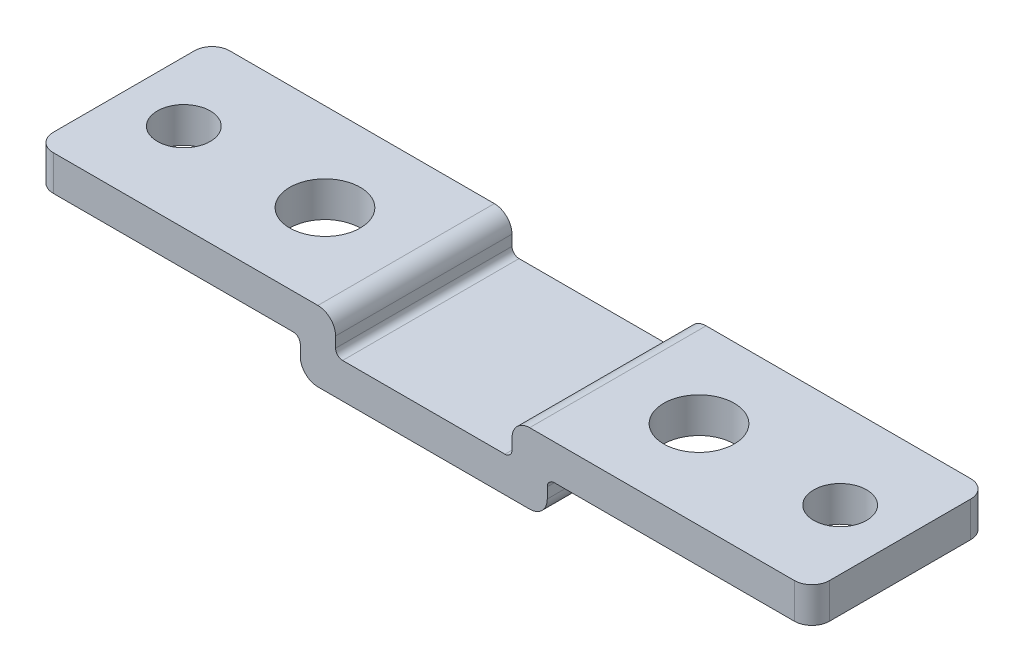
ISO-10303-21;
HEADER;
FILE_DESCRIPTION(('STEP AP214'),'2;1');
FILE_NAME('part.step','',(''),(''),'','','');
FILE_SCHEMA(('AUTOMOTIVE_DESIGN { 1 0 10303 214 1 1 1 1 }'));
ENDSEC;
DATA;
#1=APPLICATION_CONTEXT('core data for automotive mechanical design processes');
#2=APPLICATION_PROTOCOL_DEFINITION('international standard','automotive_design',2000,#1);
#3=PRODUCT_CONTEXT('',#1,'mechanical');
#4=PRODUCT('Part','Part','',(#3));
#5=PRODUCT_RELATED_PRODUCT_CATEGORY('part','',(#4));
#6=PRODUCT_DEFINITION_FORMATION('','',#4);
#7=PRODUCT_DEFINITION_CONTEXT('part definition',#1,'design');
#8=PRODUCT_DEFINITION('design','',#6,#7);
#9=PRODUCT_DEFINITION_SHAPE('','',#8);
#10=(LENGTH_UNIT() NAMED_UNIT(*) SI_UNIT(.MILLI.,.METRE.));
#11=(NAMED_UNIT(*) PLANE_ANGLE_UNIT() SI_UNIT($,.RADIAN.));
#12=(NAMED_UNIT(*) SI_UNIT($,.STERADIAN.) SOLID_ANGLE_UNIT());
#13=UNCERTAINTY_MEASURE_WITH_UNIT(LENGTH_MEASURE(1.E-05),#10,'distance_accuracy_value','');
#14=(GEOMETRIC_REPRESENTATION_CONTEXT(3) GLOBAL_UNCERTAINTY_ASSIGNED_CONTEXT((#13)) GLOBAL_UNIT_ASSIGNED_CONTEXT((#10,
#11,#12)) REPRESENTATION_CONTEXT('',''));
#15=CARTESIAN_POINT('',(0.,0.,0.));
#16=DIRECTION('',(0.,0.,1.));
#17=DIRECTION('',(1.,0.,0.));
#18=AXIS2_PLACEMENT_3D('',#15,#16,#17);
#19=CARTESIAN_POINT('',(-15.6273201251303,3.78748696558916,5.));
#20=DIRECTION('',(0.,-1.,0.));
#21=DIRECTION('',(1.,0.,0.));
#22=AXIS2_PLACEMENT_3D('',#19,#20,#21);
#23=PLANE('',#22);
#24=DIRECTION('',(-1.,0.,0.));
#25=VECTOR('',#24,1.);
#26=CARTESIAN_POINT('',(-15.6273201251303,3.78748696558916,0.));
#27=LINE('',#26,#25);
#28=CARTESIAN_POINT('',(-11.0273201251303,3.78748696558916,0.));
#29=VERTEX_POINT('',#28);
#30=CARTESIAN_POINT('',(-15.6273201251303,3.78748696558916,0.));
#31=VERTEX_POINT('',#30);
#32=EDGE_CURVE('E197',#29,#31,#27,.T.);
#33=ORIENTED_EDGE('',*,*,#32,.T.);
#34=DIRECTION('',(0.,0.,-1.));
#35=VECTOR('',#34,1.);
#36=CARTESIAN_POINT('',(-15.6273201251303,3.78748696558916,5.));
#37=LINE('',#36,#35);
#38=CARTESIAN_POINT('',(-15.6273201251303,3.78748696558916,5.));
#39=VERTEX_POINT('',#38);
#40=EDGE_CURVE('E324',#39,#31,#37,.T.);
#41=ORIENTED_EDGE('',*,*,#40,.F.);
#42=DIRECTION('',(-1.,0.,0.));
#43=VECTOR('',#42,1.);
#44=CARTESIAN_POINT('',(-15.6273201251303,3.78748696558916,5.));
#45=LINE('',#44,#43);
#46=CARTESIAN_POINT('',(-11.0273201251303,3.78748696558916,5.));
#47=VERTEX_POINT('',#46);
#48=EDGE_CURVE('E221',#47,#39,#45,.T.);
#49=ORIENTED_EDGE('',*,*,#48,.F.);
#50=DIRECTION('',(0.,0.,-1.));
#51=VECTOR('',#50,1.);
#52=CARTESIAN_POINT('',(-11.0273201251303,3.78748696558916,5.));
#53=LINE('',#52,#51);
#54=EDGE_CURVE('E215',#47,#29,#53,.T.);
#55=ORIENTED_EDGE('',*,*,#54,.T.);
#56=EDGE_LOOP('',(#33,#41,#49,#55));
#57=FACE_BOUND('',#56,.T.);
#58=ADVANCED_FACE('F35',(#57),#23,.F.);
#59=CARTESIAN_POINT('',(-15.6273201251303,3.98748696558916,5.));
#60=DIRECTION('',(0.,0.,-1.));
#61=DIRECTION('',(-1.,0.,0.));
#62=AXIS2_PLACEMENT_3D('',#59,#60,#61);
#63=CYLINDRICAL_SURFACE('',#62,0.199999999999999);
#64=CARTESIAN_POINT('',(-15.6273201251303,3.98748696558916,0.));
#65=DIRECTION('',(0.,0.,-1.));
#66=DIRECTION('',(1.,0.,0.));
#67=AXIS2_PLACEMENT_3D('',#64,#65,#66);
#68=CIRCLE('',#67,0.199999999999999);
#69=CARTESIAN_POINT('',(-15.8273201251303,3.98748696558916,0.));
#70=VERTEX_POINT('',#69);
#71=EDGE_CURVE('E203',#31,#70,#68,.T.);
#72=ORIENTED_EDGE('',*,*,#71,.T.);
#73=DIRECTION('',(0.,0.,-1.));
#74=VECTOR('',#73,1.);
#75=CARTESIAN_POINT('',(-15.8273201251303,3.98748696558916,5.));
#76=LINE('',#75,#74);
#77=CARTESIAN_POINT('',(-15.8273201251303,3.98748696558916,5.));
#78=VERTEX_POINT('',#77);
#79=EDGE_CURVE('E321',#78,#70,#76,.T.);
#80=ORIENTED_EDGE('',*,*,#79,.F.);
#81=CARTESIAN_POINT('',(-15.6273201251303,3.98748696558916,5.));
#82=DIRECTION('',(0.,0.,-1.));
#83=DIRECTION('',(1.,0.,0.));
#84=AXIS2_PLACEMENT_3D('',#81,#82,#83);
#85=CIRCLE('',#84,0.199999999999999);
#86=EDGE_CURVE('E279',#39,#78,#85,.T.);
#87=ORIENTED_EDGE('',*,*,#86,.F.);
#88=ORIENTED_EDGE('',*,*,#40,.T.);
#89=EDGE_LOOP('',(#72,#80,#87,#88));
#90=FACE_BOUND('',#89,.T.);
#91=ADVANCED_FACE('F361',(#90),#63,.F.);
#92=CARTESIAN_POINT('',(-15.8273201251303,4.28748696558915,5.));
#93=DIRECTION('',(-1.,0.,0.));
#94=DIRECTION('',(0.,0.,1.));
#95=AXIS2_PLACEMENT_3D('',#92,#93,#94);
#96=PLANE('',#95);
#97=DIRECTION('',(0.,1.,0.));
#98=VECTOR('',#97,1.);
#99=CARTESIAN_POINT('',(-15.8273201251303,4.28748696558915,0.));
#100=LINE('',#99,#98);
#101=CARTESIAN_POINT('',(-15.8273201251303,4.28748696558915,0.));
#102=VERTEX_POINT('',#101);
#103=EDGE_CURVE('E262',#70,#102,#100,.T.);
#104=ORIENTED_EDGE('',*,*,#103,.T.);
#105=DIRECTION('',(0.,0.,-1.));
#106=VECTOR('',#105,1.);
#107=CARTESIAN_POINT('',(-15.8273201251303,4.28748696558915,5.));
#108=LINE('',#107,#106);
#109=CARTESIAN_POINT('',(-15.8273201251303,4.28748696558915,5.));
#110=VERTEX_POINT('',#109);
#111=EDGE_CURVE('E318',#110,#102,#108,.T.);
#112=ORIENTED_EDGE('',*,*,#111,.F.);
#113=DIRECTION('',(0.,1.,0.));
#114=VECTOR('',#113,1.);
#115=CARTESIAN_POINT('',(-15.8273201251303,4.28748696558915,5.));
#116=LINE('',#115,#114);
#117=EDGE_CURVE('E281',#78,#110,#116,.T.);
#118=ORIENTED_EDGE('',*,*,#117,.F.);
#119=ORIENTED_EDGE('',*,*,#79,.T.);
#120=EDGE_LOOP('',(#104,#112,#118,#119));
#121=FACE_BOUND('',#120,.T.);
#122=ADVANCED_FACE('F365',(#121),#96,.F.);
#123=CARTESIAN_POINT('',(-16.3273201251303,4.28748696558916,5.));
#124=DIRECTION('',(0.,0.,-1.));
#125=DIRECTION('',(-1.,0.,0.));
#126=AXIS2_PLACEMENT_3D('',#123,#124,#125);
#127=CYLINDRICAL_SURFACE('',#126,0.5);
#128=CARTESIAN_POINT('',(-16.3273201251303,4.28748696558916,0.));
#129=DIRECTION('',(0.,0.,1.));
#130=DIRECTION('',(-1.,0.,0.));
#131=AXIS2_PLACEMENT_3D('',#128,#129,#130);
#132=CIRCLE('',#131,0.5);
#133=CARTESIAN_POINT('',(-16.3273201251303,4.78748696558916,0.));
#134=VERTEX_POINT('',#133);
#135=EDGE_CURVE('E264',#102,#134,#132,.T.);
#136=ORIENTED_EDGE('',*,*,#135,.T.);
#137=DIRECTION('',(0.,0.,-1.));
#138=VECTOR('',#137,1.);
#139=CARTESIAN_POINT('',(-16.3273201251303,4.78748696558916,5.));
#140=LINE('',#139,#138);
#141=CARTESIAN_POINT('',(-16.3273201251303,4.78748696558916,5.));
#142=VERTEX_POINT('',#141);
#143=EDGE_CURVE('E315',#142,#134,#140,.T.);
#144=ORIENTED_EDGE('',*,*,#143,.F.);
#145=CARTESIAN_POINT('',(-16.3273201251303,4.28748696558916,5.));
#146=DIRECTION('',(0.,0.,1.));
#147=DIRECTION('',(-1.,0.,0.));
#148=AXIS2_PLACEMENT_3D('',#145,#146,#147);
#149=CIRCLE('',#148,0.5);
#150=EDGE_CURVE('E283',#110,#142,#149,.T.);
#151=ORIENTED_EDGE('',*,*,#150,.F.);
#152=ORIENTED_EDGE('',*,*,#111,.T.);
#153=EDGE_LOOP('',(#136,#144,#151,#152));
#154=FACE_BOUND('',#153,.T.);
#155=ADVANCED_FACE('F370',(#154),#127,.T.);
#156=CARTESIAN_POINT('',(-24.3273201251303,4.78748696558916,5.));
#157=DIRECTION('',(0.,-1.,0.));
#158=DIRECTION('',(0.,0.,-1.));
#159=AXIS2_PLACEMENT_3D('',#156,#157,#158);
#160=PLANE('',#159);
#161=CARTESIAN_POINT('',(-22.6273201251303,4.78748696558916,2.5));
#162=DIRECTION('',(0.,1.,0.));
#163=DIRECTION('',(0.,0.,1.));
#164=AXIS2_PLACEMENT_3D('',#161,#162,#163);
#165=CIRCLE('',#164,0.750000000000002);
#166=CARTESIAN_POINT('',(-22.6273201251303,4.78748696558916,3.25));
#167=VERTEX_POINT('',#166);
#168=EDGE_CURVE('E248',#167,#167,#165,.T.);
#169=ORIENTED_EDGE('',*,*,#168,.F.);
#170=EDGE_LOOP('',(#169));
#171=FACE_BOUND('',#170,.T.);
#172=CARTESIAN_POINT('',(-18.6273201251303,4.78748696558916,2.5));
#173=DIRECTION('',(0.,1.,0.));
#174=DIRECTION('',(0.,0.,1.));
#175=AXIS2_PLACEMENT_3D('',#172,#173,#174);
#176=CIRCLE('',#175,1.);
#177=CARTESIAN_POINT('',(-18.6273201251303,4.78748696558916,3.5));
#178=VERTEX_POINT('',#177);
#179=EDGE_CURVE('E258',#178,#178,#176,.T.);
#180=ORIENTED_EDGE('',*,*,#179,.F.);
#181=EDGE_LOOP('',(#180));
#182=FACE_BOUND('',#181,.T.);
#183=DIRECTION('',(0.,0.,-1.));
#184=VECTOR('',#183,1.);
#185=CARTESIAN_POINT('',(-24.3273201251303,4.78748696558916,5.));
#186=LINE('',#185,#184);
#187=CARTESIAN_POINT('',(-24.3273201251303,4.78748696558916,4.5));
#188=VERTEX_POINT('',#187);
#189=CARTESIAN_POINT('',(-24.3273201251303,4.78748696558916,0.5));
#190=VERTEX_POINT('',#189);
#191=EDGE_CURVE('E313',#188,#190,#186,.T.);
#192=ORIENTED_EDGE('',*,*,#191,.F.);
#193=CARTESIAN_POINT('',(-23.8273201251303,4.78748696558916,4.5));
#194=DIRECTION('',(0.,-1.,0.));
#195=DIRECTION('',(0.,0.,-1.));
#196=AXIS2_PLACEMENT_3D('',#193,#194,#195);
#197=CIRCLE('',#196,0.5);
#198=CARTESIAN_POINT('',(-23.8273201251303,4.78748696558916,5.));
#199=VERTEX_POINT('',#198);
#200=EDGE_CURVE('E43',#188,#199,#197,.F.);
#201=ORIENTED_EDGE('',*,*,#200,.T.);
#202=DIRECTION('',(-1.,0.,0.));
#203=VECTOR('',#202,1.);
#204=CARTESIAN_POINT('',(-24.3273201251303,4.78748696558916,5.));
#205=LINE('',#204,#203);
#206=EDGE_CURVE('E285',#142,#199,#205,.T.);
#207=ORIENTED_EDGE('',*,*,#206,.F.);
#208=ORIENTED_EDGE('',*,*,#143,.T.);
#209=DIRECTION('',(-1.,0.,0.));
#210=VECTOR('',#209,1.);
#211=CARTESIAN_POINT('',(-24.3273201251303,4.78748696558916,0.));
#212=LINE('',#211,#210);
#213=CARTESIAN_POINT('',(-23.8273201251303,4.78748696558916,0.));
#214=VERTEX_POINT('',#213);
#215=EDGE_CURVE('E266',#134,#214,#212,.T.);
#216=ORIENTED_EDGE('',*,*,#215,.T.);
#217=CARTESIAN_POINT('',(-23.8273201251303,4.78748696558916,0.5));
#218=DIRECTION('',(0.,-1.,0.));
#219=DIRECTION('',(0.,0.,-1.));
#220=AXIS2_PLACEMENT_3D('',#217,#218,#219);
#221=CIRCLE('',#220,0.5);
#222=EDGE_CURVE('E56',#214,#190,#221,.F.);
#223=ORIENTED_EDGE('',*,*,#222,.T.);
#224=EDGE_LOOP('',(#192,#201,#207,#208,#216,#223));
#225=FACE_BOUND('',#224,.T.);
#226=ADVANCED_FACE('F376',(#171,#182,#225),#160,.F.);
#227=CARTESIAN_POINT('',(-24.3273201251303,3.78748696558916,5.));
#228=DIRECTION('',(1.,0.,0.));
#229=DIRECTION('',(0.,0.,-1.));
#230=AXIS2_PLACEMENT_3D('',#227,#228,#229);
#231=PLANE('',#230);
#232=DIRECTION('',(0.,0.,-1.));
#233=VECTOR('',#232,1.);
#234=CARTESIAN_POINT('',(-24.3273201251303,3.78748696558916,5.));
#235=LINE('',#234,#233);
#236=CARTESIAN_POINT('',(-24.3273201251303,3.78748696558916,4.5));
#237=VERTEX_POINT('',#236);
#238=CARTESIAN_POINT('',(-24.3273201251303,3.78748696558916,0.5));
#239=VERTEX_POINT('',#238);
#240=EDGE_CURVE('E310',#237,#239,#235,.T.);
#241=ORIENTED_EDGE('',*,*,#240,.F.);
#242=DIRECTION('',(0.,-1.,0.));
#243=VECTOR('',#242,1.);
#244=CARTESIAN_POINT('',(-24.3273201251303,3.78748696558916,4.5));
#245=LINE('',#244,#243);
#246=EDGE_CURVE('E336',#237,#188,#245,.F.);
#247=ORIENTED_EDGE('',*,*,#246,.T.);
#248=ORIENTED_EDGE('',*,*,#191,.T.);
#249=DIRECTION('',(0.,-1.,0.));
#250=VECTOR('',#249,1.);
#251=CARTESIAN_POINT('',(-24.3273201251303,3.78748696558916,0.5));
#252=LINE('',#251,#250);
#253=EDGE_CURVE('E333',#190,#239,#252,.T.);
#254=ORIENTED_EDGE('',*,*,#253,.T.);
#255=EDGE_LOOP('',(#241,#247,#248,#254));
#256=FACE_BOUND('',#255,.T.);
#257=ADVANCED_FACE('F380',(#256),#231,.F.);
#258=CARTESIAN_POINT('',(-17.0273201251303,3.78748696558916,5.));
#259=DIRECTION('',(0.,1.,0.));
#260=DIRECTION('',(0.,0.,1.));
#261=AXIS2_PLACEMENT_3D('',#258,#259,#260);
#262=PLANE('',#261);
#263=CARTESIAN_POINT('',(-22.6273201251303,3.78748696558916,2.5));
#264=DIRECTION('',(0.,1.,0.));
#265=DIRECTION('',(0.,0.,1.));
#266=AXIS2_PLACEMENT_3D('',#263,#264,#265);
#267=CIRCLE('',#266,0.750000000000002);
#268=CARTESIAN_POINT('',(-22.6273201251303,3.78748696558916,3.25));
#269=VERTEX_POINT('',#268);
#270=EDGE_CURVE('E38',#269,#269,#267,.T.);
#271=ORIENTED_EDGE('',*,*,#270,.T.);
#272=EDGE_LOOP('',(#271));
#273=FACE_BOUND('',#272,.T.);
#274=CARTESIAN_POINT('',(-18.6273201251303,3.78748696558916,2.5));
#275=DIRECTION('',(0.,1.,0.));
#276=DIRECTION('',(0.,0.,1.));
#277=AXIS2_PLACEMENT_3D('',#274,#275,#276);
#278=CIRCLE('',#277,1.);
#279=CARTESIAN_POINT('',(-18.6273201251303,3.78748696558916,3.5));
#280=VERTEX_POINT('',#279);
#281=EDGE_CURVE('E208',#280,#280,#278,.T.);
#282=ORIENTED_EDGE('',*,*,#281,.T.);
#283=EDGE_LOOP('',(#282));
#284=FACE_BOUND('',#283,.T.);
#285=DIRECTION('',(1.,0.,0.));
#286=VECTOR('',#285,1.);
#287=CARTESIAN_POINT('',(-17.0273201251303,3.78748696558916,5.));
#288=LINE('',#287,#286);
#289=CARTESIAN_POINT('',(-23.8273201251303,3.78748696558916,5.));
#290=VERTEX_POINT('',#289);
#291=CARTESIAN_POINT('',(-17.0273201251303,3.78748696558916,5.));
#292=VERTEX_POINT('',#291);
#293=EDGE_CURVE('E288',#290,#292,#288,.T.);
#294=ORIENTED_EDGE('',*,*,#293,.F.);
#295=CARTESIAN_POINT('',(-23.8273201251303,3.78748696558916,4.5));
#296=DIRECTION('',(0.,1.,0.));
#297=DIRECTION('',(0.,0.,1.));
#298=AXIS2_PLACEMENT_3D('',#295,#296,#297);
#299=CIRCLE('',#298,0.5);
#300=EDGE_CURVE('E331',#290,#237,#299,.F.);
#301=ORIENTED_EDGE('',*,*,#300,.T.);
#302=ORIENTED_EDGE('',*,*,#240,.T.);
#303=CARTESIAN_POINT('',(-23.8273201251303,3.78748696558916,0.5));
#304=DIRECTION('',(0.,1.,0.));
#305=DIRECTION('',(0.,0.,1.));
#306=AXIS2_PLACEMENT_3D('',#303,#304,#305);
#307=CIRCLE('',#306,0.5);
#308=CARTESIAN_POINT('',(-23.8273201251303,3.78748696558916,0.));
#309=VERTEX_POINT('',#308);
#310=EDGE_CURVE('E329',#239,#309,#307,.F.);
#311=ORIENTED_EDGE('',*,*,#310,.T.);
#312=DIRECTION('',(1.,0.,0.));
#313=VECTOR('',#312,1.);
#314=CARTESIAN_POINT('',(-17.0273201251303,3.78748696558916,0.));
#315=LINE('',#314,#313);
#316=CARTESIAN_POINT('',(-17.0273201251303,3.78748696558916,0.));
#317=VERTEX_POINT('',#316);
#318=EDGE_CURVE('E268',#309,#317,#315,.T.);
#319=ORIENTED_EDGE('',*,*,#318,.T.);
#320=DIRECTION('',(0.,0.,-1.));
#321=VECTOR('',#320,1.);
#322=CARTESIAN_POINT('',(-17.0273201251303,3.78748696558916,5.));
#323=LINE('',#322,#321);
#324=EDGE_CURVE('E307',#292,#317,#323,.T.);
#325=ORIENTED_EDGE('',*,*,#324,.F.);
#326=EDGE_LOOP('',(#294,#301,#302,#311,#319,#325));
#327=FACE_BOUND('',#326,.T.);
#328=ADVANCED_FACE('F342',(#273,#284,#327),#262,.F.);
#329=CARTESIAN_POINT('',(-17.0273201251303,3.58748696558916,5.));
#330=DIRECTION('',(0.,0.,-1.));
#331=DIRECTION('',(-1.,0.,0.));
#332=AXIS2_PLACEMENT_3D('',#329,#330,#331);
#333=CYLINDRICAL_SURFACE('',#332,0.199999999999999);
#334=CARTESIAN_POINT('',(-17.0273201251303,3.58748696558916,0.));
#335=DIRECTION('',(0.,0.,-1.));
#336=DIRECTION('',(1.,0.,0.));
#337=AXIS2_PLACEMENT_3D('',#334,#335,#336);
#338=CIRCLE('',#337,0.199999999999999);
#339=CARTESIAN_POINT('',(-16.8273201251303,3.58748696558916,0.));
#340=VERTEX_POINT('',#339);
#341=EDGE_CURVE('E270',#317,#340,#338,.T.);
#342=ORIENTED_EDGE('',*,*,#341,.T.);
#343=DIRECTION('',(0.,0.,-1.));
#344=VECTOR('',#343,1.);
#345=CARTESIAN_POINT('',(-16.8273201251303,3.58748696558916,5.));
#346=LINE('',#345,#344);
#347=CARTESIAN_POINT('',(-16.8273201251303,3.58748696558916,5.));
#348=VERTEX_POINT('',#347);
#349=EDGE_CURVE('E304',#348,#340,#346,.T.);
#350=ORIENTED_EDGE('',*,*,#349,.F.);
#351=CARTESIAN_POINT('',(-17.0273201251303,3.58748696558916,5.));
#352=DIRECTION('',(0.,0.,-1.));
#353=DIRECTION('',(1.,0.,0.));
#354=AXIS2_PLACEMENT_3D('',#351,#352,#353);
#355=CIRCLE('',#354,0.199999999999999);
#356=EDGE_CURVE('E290',#292,#348,#355,.T.);
#357=ORIENTED_EDGE('',*,*,#356,.F.);
#358=ORIENTED_EDGE('',*,*,#324,.T.);
#359=EDGE_LOOP('',(#342,#350,#357,#358));
#360=FACE_BOUND('',#359,.T.);
#361=ADVANCED_FACE('F387',(#360),#333,.F.);
#362=CARTESIAN_POINT('',(-16.8273201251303,3.28748696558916,5.));
#363=DIRECTION('',(1.,0.,0.));
#364=DIRECTION('',(0.,0.,-1.));
#365=AXIS2_PLACEMENT_3D('',#362,#363,#364);
#366=PLANE('',#365);
#367=DIRECTION('',(0.,-1.,0.));
#368=VECTOR('',#367,1.);
#369=CARTESIAN_POINT('',(-16.8273201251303,3.28748696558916,0.));
#370=LINE('',#369,#368);
#371=CARTESIAN_POINT('',(-16.8273201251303,3.28748696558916,0.));
#372=VERTEX_POINT('',#371);
#373=EDGE_CURVE('E272',#340,#372,#370,.T.);
#374=ORIENTED_EDGE('',*,*,#373,.T.);
#375=DIRECTION('',(0.,0.,-1.));
#376=VECTOR('',#375,1.);
#377=CARTESIAN_POINT('',(-16.8273201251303,3.28748696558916,5.));
#378=LINE('',#377,#376);
#379=CARTESIAN_POINT('',(-16.8273201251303,3.28748696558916,5.));
#380=VERTEX_POINT('',#379);
#381=EDGE_CURVE('E301',#380,#372,#378,.T.);
#382=ORIENTED_EDGE('',*,*,#381,.F.);
#383=DIRECTION('',(0.,-1.,0.));
#384=VECTOR('',#383,1.);
#385=CARTESIAN_POINT('',(-16.8273201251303,3.28748696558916,5.));
#386=LINE('',#385,#384);
#387=EDGE_CURVE('E292',#348,#380,#386,.T.);
#388=ORIENTED_EDGE('',*,*,#387,.F.);
#389=ORIENTED_EDGE('',*,*,#349,.T.);
#390=EDGE_LOOP('',(#374,#382,#388,#389));
#391=FACE_BOUND('',#390,.T.);
#392=ADVANCED_FACE('F391',(#391),#366,.F.);
#393=CARTESIAN_POINT('',(-16.3273201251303,3.28748696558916,5.));
#394=DIRECTION('',(0.,0.,-1.));
#395=DIRECTION('',(-1.,0.,0.));
#396=AXIS2_PLACEMENT_3D('',#393,#394,#395);
#397=CYLINDRICAL_SURFACE('',#396,0.5);
#398=CARTESIAN_POINT('',(-16.3273201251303,3.28748696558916,0.));
#399=DIRECTION('',(0.,0.,1.));
#400=DIRECTION('',(-1.,0.,0.));
#401=AXIS2_PLACEMENT_3D('',#398,#399,#400);
#402=CIRCLE('',#401,0.5);
#403=CARTESIAN_POINT('',(-16.3273201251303,2.78748696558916,0.));
#404=VERTEX_POINT('',#403);
#405=EDGE_CURVE('E274',#372,#404,#402,.T.);
#406=ORIENTED_EDGE('',*,*,#405,.T.);
#407=DIRECTION('',(0.,0.,-1.));
#408=VECTOR('',#407,1.);
#409=CARTESIAN_POINT('',(-16.3273201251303,2.78748696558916,5.));
#410=LINE('',#409,#408);
#411=CARTESIAN_POINT('',(-16.3273201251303,2.78748696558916,5.));
#412=VERTEX_POINT('',#411);
#413=EDGE_CURVE('E298',#412,#404,#410,.T.);
#414=ORIENTED_EDGE('',*,*,#413,.F.);
#415=CARTESIAN_POINT('',(-16.3273201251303,3.28748696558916,5.));
#416=DIRECTION('',(0.,0.,1.));
#417=DIRECTION('',(-1.,0.,0.));
#418=AXIS2_PLACEMENT_3D('',#415,#416,#417);
#419=CIRCLE('',#418,0.5);
#420=EDGE_CURVE('E294',#380,#412,#419,.T.);
#421=ORIENTED_EDGE('',*,*,#420,.F.);
#422=ORIENTED_EDGE('',*,*,#381,.T.);
#423=EDGE_LOOP('',(#406,#414,#421,#422));
#424=FACE_BOUND('',#423,.T.);
#425=ADVANCED_FACE('F395',(#424),#397,.T.);
#426=CARTESIAN_POINT('',(-13.3273201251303,2.78748696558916,5.));
#427=DIRECTION('',(0.,1.,0.));
#428=DIRECTION('',(-1.,0.,0.));
#429=AXIS2_PLACEMENT_3D('',#426,#427,#428);
#430=PLANE('',#429);
#431=DIRECTION('',(1.,0.,0.));
#432=VECTOR('',#431,1.);
#433=CARTESIAN_POINT('',(-13.3273201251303,2.78748696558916,0.));
#434=LINE('',#433,#432);
#435=CARTESIAN_POINT('',(-10.3273201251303,2.78748696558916,0.));
#436=VERTEX_POINT('',#435);
#437=EDGE_CURVE('E276',#404,#436,#434,.T.);
#438=ORIENTED_EDGE('',*,*,#437,.T.);
#439=DIRECTION('',(0.,0.,-1.));
#440=VECTOR('',#439,1.);
#441=CARTESIAN_POINT('',(-10.3273201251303,2.78748696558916,5.));
#442=LINE('',#441,#440);
#443=CARTESIAN_POINT('',(-10.3273201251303,2.78748696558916,5.));
#444=VERTEX_POINT('',#443);
#445=EDGE_CURVE('E455',#444,#436,#442,.T.);
#446=ORIENTED_EDGE('',*,*,#445,.F.);
#447=DIRECTION('',(1.,0.,0.));
#448=VECTOR('',#447,1.);
#449=CARTESIAN_POINT('',(-13.3273201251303,2.78748696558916,5.));
#450=LINE('',#449,#448);
#451=EDGE_CURVE('E296',#412,#444,#450,.T.);
#452=ORIENTED_EDGE('',*,*,#451,.F.);
#453=ORIENTED_EDGE('',*,*,#413,.T.);
#454=EDGE_LOOP('',(#438,#446,#452,#453));
#455=FACE_BOUND('',#454,.T.);
#456=ADVANCED_FACE('F399',(#455),#430,.F.);
#457=CARTESIAN_POINT('',(-16.3273201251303,3.28748696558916,5.));
#458=DIRECTION('',(0.,0.,-1.));
#459=DIRECTION('',(-1.,0.,0.));
#460=AXIS2_PLACEMENT_3D('',#457,#458,#459);
#461=PLANE('',#460);
#462=ORIENTED_EDGE('',*,*,#206,.T.);
#463=DIRECTION('',(0.,-1.,0.));
#464=VECTOR('',#463,1.);
#465=CARTESIAN_POINT('',(-23.8273201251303,3.28748696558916,5.));
#466=LINE('',#465,#464);
#467=EDGE_CURVE('E326',#199,#290,#466,.T.);
#468=ORIENTED_EDGE('',*,*,#467,.T.);
#469=ORIENTED_EDGE('',*,*,#293,.T.);
#470=ORIENTED_EDGE('',*,*,#356,.T.);
#471=ORIENTED_EDGE('',*,*,#387,.T.);
#472=ORIENTED_EDGE('',*,*,#420,.T.);
#473=ORIENTED_EDGE('',*,*,#451,.T.);
#474=CARTESIAN_POINT('',(-10.3273201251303,3.28748696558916,5.));
#475=DIRECTION('',(0.,0.,-1.));
#476=DIRECTION('',(1.,0.,0.));
#477=AXIS2_PLACEMENT_3D('',#474,#475,#476);
#478=CIRCLE('',#477,0.5);
#479=CARTESIAN_POINT('',(-9.82732012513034,3.28748696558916,5.));
#480=VERTEX_POINT('',#479);
#481=EDGE_CURVE('E452',#480,#444,#478,.T.);
#482=ORIENTED_EDGE('',*,*,#481,.F.);
#483=DIRECTION('',(0.,-1.,0.));
#484=VECTOR('',#483,1.);
#485=CARTESIAN_POINT('',(-9.82732012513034,3.28748696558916,5.));
#486=LINE('',#485,#484);
#487=CARTESIAN_POINT('',(-9.82732012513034,3.58748696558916,5.));
#488=VERTEX_POINT('',#487);
#489=EDGE_CURVE('E449',#488,#480,#486,.T.);
#490=ORIENTED_EDGE('',*,*,#489,.F.);
#491=CARTESIAN_POINT('',(-9.62732012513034,3.58748696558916,5.));
#492=DIRECTION('',(0.,0.,1.));
#493=DIRECTION('',(-1.,0.,0.));
#494=AXIS2_PLACEMENT_3D('',#491,#492,#493);
#495=CIRCLE('',#494,0.199999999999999);
#496=CARTESIAN_POINT('',(-9.62732012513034,3.78748696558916,5.));
#497=VERTEX_POINT('',#496);
#498=EDGE_CURVE('E446',#497,#488,#495,.T.);
#499=ORIENTED_EDGE('',*,*,#498,.F.);
#500=DIRECTION('',(-1.,0.,0.));
#501=VECTOR('',#500,1.);
#502=CARTESIAN_POINT('',(-9.62732012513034,3.78748696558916,5.));
#503=LINE('',#502,#501);
#504=CARTESIAN_POINT('',(-2.82732012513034,3.78748696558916,5.));
#505=VERTEX_POINT('',#504);
#506=EDGE_CURVE('E443',#505,#497,#503,.T.);
#507=ORIENTED_EDGE('',*,*,#506,.F.);
#508=DIRECTION('',(0.,-1.,0.));
#509=VECTOR('',#508,1.);
#510=CARTESIAN_POINT('',(-2.82732012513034,3.28748696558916,5.));
#511=LINE('',#510,#509);
#512=CARTESIAN_POINT('',(-2.82732012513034,4.78748696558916,5.));
#513=VERTEX_POINT('',#512);
#514=EDGE_CURVE('E223',#513,#505,#511,.T.);
#515=ORIENTED_EDGE('',*,*,#514,.F.);
#516=DIRECTION('',(1.,0.,0.));
#517=VECTOR('',#516,1.);
#518=CARTESIAN_POINT('',(-2.32732012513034,4.78748696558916,5.));
#519=LINE('',#518,#517);
#520=CARTESIAN_POINT('',(-10.3273201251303,4.78748696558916,5.));
#521=VERTEX_POINT('',#520);
#522=EDGE_CURVE('E440',#521,#513,#519,.T.);
#523=ORIENTED_EDGE('',*,*,#522,.F.);
#524=CARTESIAN_POINT('',(-10.3273201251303,4.28748696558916,5.));
#525=DIRECTION('',(0.,0.,-1.));
#526=DIRECTION('',(1.,0.,0.));
#527=AXIS2_PLACEMENT_3D('',#524,#525,#526);
#528=CIRCLE('',#527,0.5);
#529=CARTESIAN_POINT('',(-10.8273201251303,4.28748696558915,5.));
#530=VERTEX_POINT('',#529);
#531=EDGE_CURVE('E431',#530,#521,#528,.T.);
#532=ORIENTED_EDGE('',*,*,#531,.F.);
#533=DIRECTION('',(0.,1.,0.));
#534=VECTOR('',#533,1.);
#535=CARTESIAN_POINT('',(-10.8273201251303,4.28748696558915,5.));
#536=LINE('',#535,#534);
#537=CARTESIAN_POINT('',(-10.8273201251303,3.98748696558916,5.));
#538=VERTEX_POINT('',#537);
#539=EDGE_CURVE('E428',#538,#530,#536,.T.);
#540=ORIENTED_EDGE('',*,*,#539,.F.);
#541=CARTESIAN_POINT('',(-11.0273201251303,3.98748696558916,5.));
#542=DIRECTION('',(0.,0.,1.));
#543=DIRECTION('',(-1.,0.,0.));
#544=AXIS2_PLACEMENT_3D('',#541,#542,#543);
#545=CIRCLE('',#544,0.199999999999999);
#546=EDGE_CURVE('E426',#47,#538,#545,.T.);
#547=ORIENTED_EDGE('',*,*,#546,.F.);
#548=ORIENTED_EDGE('',*,*,#48,.T.);
#549=ORIENTED_EDGE('',*,*,#86,.T.);
#550=ORIENTED_EDGE('',*,*,#117,.T.);
#551=ORIENTED_EDGE('',*,*,#150,.T.);
#552=EDGE_LOOP('',(#462,#468,#469,#470,#471,#472,#473,#482,#490,#499,#507,#515,#523,#532,#540,
#547,#548,#549,#550,#551));
#553=FACE_BOUND('',#552,.T.);
#554=ADVANCED_FACE('F403',(#553),#461,.F.);
#555=CARTESIAN_POINT('',(-16.3273201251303,3.28748696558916,0.));
#556=DIRECTION('',(0.,0.,-1.));
#557=DIRECTION('',(-1.,0.,0.));
#558=AXIS2_PLACEMENT_3D('',#555,#556,#557);
#559=PLANE('',#558);
#560=ORIENTED_EDGE('',*,*,#318,.F.);
#561=DIRECTION('',(0.,-1.,0.));
#562=VECTOR('',#561,1.);
#563=CARTESIAN_POINT('',(-23.8273201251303,4.78748696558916,0.));
#564=LINE('',#563,#562);
#565=EDGE_CURVE('E11',#309,#214,#564,.F.);
#566=ORIENTED_EDGE('',*,*,#565,.T.);
#567=ORIENTED_EDGE('',*,*,#215,.F.);
#568=ORIENTED_EDGE('',*,*,#135,.F.);
#569=ORIENTED_EDGE('',*,*,#103,.F.);
#570=ORIENTED_EDGE('',*,*,#71,.F.);
#571=ORIENTED_EDGE('',*,*,#32,.F.);
#572=CARTESIAN_POINT('',(-11.0273201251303,3.98748696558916,0.));
#573=DIRECTION('',(0.,0.,1.));
#574=DIRECTION('',(-1.,0.,0.));
#575=AXIS2_PLACEMENT_3D('',#572,#573,#574);
#576=CIRCLE('',#575,0.199999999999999);
#577=CARTESIAN_POINT('',(-10.8273201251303,3.98748696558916,0.));
#578=VERTEX_POINT('',#577);
#579=EDGE_CURVE('E201',#29,#578,#576,.T.);
#580=ORIENTED_EDGE('',*,*,#579,.T.);
#581=DIRECTION('',(0.,1.,0.));
#582=VECTOR('',#581,1.);
#583=CARTESIAN_POINT('',(-10.8273201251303,4.28748696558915,0.));
#584=LINE('',#583,#582);
#585=CARTESIAN_POINT('',(-10.8273201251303,4.28748696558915,0.));
#586=VERTEX_POINT('',#585);
#587=EDGE_CURVE('E218',#578,#586,#584,.T.);
#588=ORIENTED_EDGE('',*,*,#587,.T.);
#589=CARTESIAN_POINT('',(-10.3273201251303,4.28748696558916,0.));
#590=DIRECTION('',(0.,0.,-1.));
#591=DIRECTION('',(1.,0.,0.));
#592=AXIS2_PLACEMENT_3D('',#589,#590,#591);
#593=CIRCLE('',#592,0.5);
#594=CARTESIAN_POINT('',(-10.3273201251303,4.78748696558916,0.));
#595=VERTEX_POINT('',#594);
#596=EDGE_CURVE('E482',#586,#595,#593,.T.);
#597=ORIENTED_EDGE('',*,*,#596,.T.);
#598=DIRECTION('',(1.,0.,0.));
#599=VECTOR('',#598,1.);
#600=CARTESIAN_POINT('',(-2.32732012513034,4.78748696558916,0.));
#601=LINE('',#600,#599);
#602=CARTESIAN_POINT('',(-2.82732012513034,4.78748696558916,0.));
#603=VERTEX_POINT('',#602);
#604=EDGE_CURVE('E484',#595,#603,#601,.T.);
#605=ORIENTED_EDGE('',*,*,#604,.T.);
#606=DIRECTION('',(0.,-1.,0.));
#607=VECTOR('',#606,1.);
#608=CARTESIAN_POINT('',(-2.82732012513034,4.78748696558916,0.));
#609=LINE('',#608,#607);
#610=CARTESIAN_POINT('',(-2.82732012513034,3.78748696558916,0.));
#611=VERTEX_POINT('',#610);
#612=EDGE_CURVE('E246',#611,#603,#609,.F.);
#613=ORIENTED_EDGE('',*,*,#612,.F.);
#614=DIRECTION('',(-1.,0.,0.));
#615=VECTOR('',#614,1.);
#616=CARTESIAN_POINT('',(-9.62732012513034,3.78748696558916,0.));
#617=LINE('',#616,#615);
#618=CARTESIAN_POINT('',(-9.62732012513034,3.78748696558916,0.));
#619=VERTEX_POINT('',#618);
#620=EDGE_CURVE('E489',#611,#619,#617,.T.);
#621=ORIENTED_EDGE('',*,*,#620,.T.);
#622=CARTESIAN_POINT('',(-9.62732012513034,3.58748696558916,0.));
#623=DIRECTION('',(0.,0.,1.));
#624=DIRECTION('',(-1.,0.,0.));
#625=AXIS2_PLACEMENT_3D('',#622,#623,#624);
#626=CIRCLE('',#625,0.199999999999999);
#627=CARTESIAN_POINT('',(-9.82732012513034,3.58748696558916,0.));
#628=VERTEX_POINT('',#627);
#629=EDGE_CURVE('E492',#619,#628,#626,.T.);
#630=ORIENTED_EDGE('',*,*,#629,.T.);
#631=DIRECTION('',(0.,-1.,0.));
#632=VECTOR('',#631,1.);
#633=CARTESIAN_POINT('',(-9.82732012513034,3.28748696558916,0.));
#634=LINE('',#633,#632);
#635=CARTESIAN_POINT('',(-9.82732012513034,3.28748696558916,0.));
#636=VERTEX_POINT('',#635);
#637=EDGE_CURVE('E434',#628,#636,#634,.T.);
#638=ORIENTED_EDGE('',*,*,#637,.T.);
#639=CARTESIAN_POINT('',(-10.3273201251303,3.28748696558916,0.));
#640=DIRECTION('',(0.,0.,-1.));
#641=DIRECTION('',(1.,0.,0.));
#642=AXIS2_PLACEMENT_3D('',#639,#640,#641);
#643=CIRCLE('',#642,0.5);
#644=EDGE_CURVE('E429',#636,#436,#643,.T.);
#645=ORIENTED_EDGE('',*,*,#644,.T.);
#646=ORIENTED_EDGE('',*,*,#437,.F.);
#647=ORIENTED_EDGE('',*,*,#405,.F.);
#648=ORIENTED_EDGE('',*,*,#373,.F.);
#649=ORIENTED_EDGE('',*,*,#341,.F.);
#650=EDGE_LOOP('',(#560,#566,#567,#568,#569,#570,#571,#580,#588,#597,#605,#613,#621,#630,#638,
#645,#646,#647,#648,#649));
#651=FACE_BOUND('',#650,.T.);
#652=ADVANCED_FACE('F199',(#651),#559,.T.);
#653=CARTESIAN_POINT('',(-23.8273201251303,3.28748696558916,4.5));
#654=DIRECTION('',(0.,-1.,0.));
#655=DIRECTION('',(0.,0.,-1.));
#656=AXIS2_PLACEMENT_3D('',#653,#654,#655);
#657=CYLINDRICAL_SURFACE('',#656,0.5);
#658=ORIENTED_EDGE('',*,*,#200,.F.);
#659=ORIENTED_EDGE('',*,*,#246,.F.);
#660=ORIENTED_EDGE('',*,*,#300,.F.);
#661=ORIENTED_EDGE('',*,*,#467,.F.);
#662=EDGE_LOOP('',(#658,#659,#660,#661));
#663=FACE_BOUND('',#662,.T.);
#664=ADVANCED_FACE('F357',(#663),#657,.T.);
#665=CARTESIAN_POINT('',(-23.8273201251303,3.78748696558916,0.5));
#666=DIRECTION('',(0.,1.,0.));
#667=DIRECTION('',(0.,0.,1.));
#668=AXIS2_PLACEMENT_3D('',#665,#666,#667);
#669=CYLINDRICAL_SURFACE('',#668,0.5);
#670=ORIENTED_EDGE('',*,*,#222,.F.);
#671=ORIENTED_EDGE('',*,*,#565,.F.);
#672=ORIENTED_EDGE('',*,*,#310,.F.);
#673=ORIENTED_EDGE('',*,*,#253,.F.);
#674=EDGE_LOOP('',(#670,#671,#672,#673));
#675=FACE_BOUND('',#674,.T.);
#676=ADVANCED_FACE('F348',(#675),#669,.T.);
#677=CARTESIAN_POINT('',(-18.6273201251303,2.78748696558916,2.5));
#678=DIRECTION('',(0.,1.,0.));
#679=DIRECTION('',(0.,0.,1.));
#680=AXIS2_PLACEMENT_3D('',#677,#678,#679);
#681=CYLINDRICAL_SURFACE('',#680,1.);
#682=ORIENTED_EDGE('',*,*,#179,.T.);
#683=EDGE_LOOP('',(#682));
#684=FACE_BOUND('',#683,.T.);
#685=ORIENTED_EDGE('',*,*,#281,.F.);
#686=EDGE_LOOP('',(#685));
#687=FACE_BOUND('',#686,.T.);
#688=ADVANCED_FACE('F345',(#684,#687),#681,.F.);
#689=CARTESIAN_POINT('',(-22.6273201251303,2.78748696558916,2.5));
#690=DIRECTION('',(0.,1.,0.));
#691=DIRECTION('',(0.,0.,1.));
#692=AXIS2_PLACEMENT_3D('',#689,#690,#691);
#693=CYLINDRICAL_SURFACE('',#692,0.750000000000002);
#694=ORIENTED_EDGE('',*,*,#168,.T.);
#695=EDGE_LOOP('',(#694));
#696=FACE_BOUND('',#695,.T.);
#697=ORIENTED_EDGE('',*,*,#270,.F.);
#698=EDGE_LOOP('',(#697));
#699=FACE_BOUND('',#698,.T.);
#700=ADVANCED_FACE('F347',(#696,#699),#693,.F.);
#701=CARTESIAN_POINT('',(-11.0273201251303,3.98748696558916,5.));
#702=DIRECTION('',(0.,0.,-1.));
#703=DIRECTION('',(1.,0.,0.));
#704=AXIS2_PLACEMENT_3D('',#701,#702,#703);
#705=CYLINDRICAL_SURFACE('',#704,0.199999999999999);
#706=ORIENTED_EDGE('',*,*,#579,.F.);
#707=ORIENTED_EDGE('',*,*,#54,.F.);
#708=ORIENTED_EDGE('',*,*,#546,.T.);
#709=DIRECTION('',(0.,0.,-1.));
#710=VECTOR('',#709,1.);
#711=CARTESIAN_POINT('',(-10.8273201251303,3.98748696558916,5.));
#712=LINE('',#711,#710);
#713=EDGE_CURVE('E217',#538,#578,#712,.T.);
#714=ORIENTED_EDGE('',*,*,#713,.T.);
#715=EDGE_LOOP('',(#706,#707,#708,#714));
#716=FACE_BOUND('',#715,.T.);
#717=ADVANCED_FACE('F213',(#716),#705,.F.);
#718=CARTESIAN_POINT('',(-10.8273201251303,4.28748696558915,5.));
#719=DIRECTION('',(1.,0.,0.));
#720=DIRECTION('',(0.,0.,1.));
#721=AXIS2_PLACEMENT_3D('',#718,#719,#720);
#722=PLANE('',#721);
#723=ORIENTED_EDGE('',*,*,#587,.F.);
#724=ORIENTED_EDGE('',*,*,#713,.F.);
#725=ORIENTED_EDGE('',*,*,#539,.T.);
#726=DIRECTION('',(0.,0.,-1.));
#727=VECTOR('',#726,1.);
#728=CARTESIAN_POINT('',(-10.8273201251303,4.28748696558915,5.));
#729=LINE('',#728,#727);
#730=EDGE_CURVE('E227',#530,#586,#729,.T.);
#731=ORIENTED_EDGE('',*,*,#730,.T.);
#732=EDGE_LOOP('',(#723,#724,#725,#731));
#733=FACE_BOUND('',#732,.T.);
#734=ADVANCED_FACE('F478',(#733),#722,.F.);
#735=CARTESIAN_POINT('',(-10.3273201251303,4.28748696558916,5.));
#736=DIRECTION('',(0.,0.,-1.));
#737=DIRECTION('',(1.,0.,0.));
#738=AXIS2_PLACEMENT_3D('',#735,#736,#737);
#739=CYLINDRICAL_SURFACE('',#738,0.5);
#740=ORIENTED_EDGE('',*,*,#596,.F.);
#741=ORIENTED_EDGE('',*,*,#730,.F.);
#742=ORIENTED_EDGE('',*,*,#531,.T.);
#743=DIRECTION('',(0.,0.,-1.));
#744=VECTOR('',#743,1.);
#745=CARTESIAN_POINT('',(-10.3273201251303,4.78748696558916,5.));
#746=LINE('',#745,#744);
#747=EDGE_CURVE('E473',#521,#595,#746,.T.);
#748=ORIENTED_EDGE('',*,*,#747,.T.);
#749=EDGE_LOOP('',(#740,#741,#742,#748));
#750=FACE_BOUND('',#749,.T.);
#751=ADVANCED_FACE('F546',(#750),#739,.T.);
#752=CARTESIAN_POINT('',(-2.32732012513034,4.78748696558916,5.));
#753=DIRECTION('',(0.,-1.,0.));
#754=DIRECTION('',(0.,0.,-1.));
#755=AXIS2_PLACEMENT_3D('',#752,#753,#754);
#756=PLANE('',#755);
#757=CARTESIAN_POINT('',(-4.02732012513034,4.78748696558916,2.5));
#758=DIRECTION('',(0.,-1.,0.));
#759=DIRECTION('',(0.,0.,1.));
#760=AXIS2_PLACEMENT_3D('',#757,#758,#759);
#761=CIRCLE('',#760,0.750000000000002);
#762=CARTESIAN_POINT('',(-4.02732012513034,4.78748696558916,3.25));
#763=VERTEX_POINT('',#762);
#764=EDGE_CURVE('E255',#763,#763,#761,.T.);
#765=ORIENTED_EDGE('',*,*,#764,.T.);
#766=EDGE_LOOP('',(#765));
#767=FACE_BOUND('',#766,.T.);
#768=CARTESIAN_POINT('',(-8.02732012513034,4.78748696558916,2.5));
#769=DIRECTION('',(0.,-1.,0.));
#770=DIRECTION('',(0.,0.,1.));
#771=AXIS2_PLACEMENT_3D('',#768,#769,#770);
#772=CIRCLE('',#771,1.);
#773=CARTESIAN_POINT('',(-8.02732012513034,4.78748696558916,3.5));
#774=VERTEX_POINT('',#773);
#775=EDGE_CURVE('E251',#774,#774,#772,.T.);
#776=ORIENTED_EDGE('',*,*,#775,.T.);
#777=EDGE_LOOP('',(#776));
#778=FACE_BOUND('',#777,.T.);
#779=DIRECTION('',(0.,0.,-1.));
#780=VECTOR('',#779,1.);
#781=CARTESIAN_POINT('',(-2.32732012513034,4.78748696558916,5.));
#782=LINE('',#781,#780);
#783=CARTESIAN_POINT('',(-2.32732012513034,4.78748696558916,4.5));
#784=VERTEX_POINT('',#783);
#785=CARTESIAN_POINT('',(-2.32732012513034,4.78748696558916,0.5));
#786=VERTEX_POINT('',#785);
#787=EDGE_CURVE('E470',#784,#786,#782,.T.);
#788=ORIENTED_EDGE('',*,*,#787,.T.);
#789=CARTESIAN_POINT('',(-2.82732012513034,4.78748696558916,0.5));
#790=DIRECTION('',(0.,1.,0.));
#791=DIRECTION('',(0.,0.,-1.));
#792=AXIS2_PLACEMENT_3D('',#789,#790,#791);
#793=CIRCLE('',#792,0.5);
#794=EDGE_CURVE('E240',#603,#786,#793,.F.);
#795=ORIENTED_EDGE('',*,*,#794,.F.);
#796=ORIENTED_EDGE('',*,*,#604,.F.);
#797=ORIENTED_EDGE('',*,*,#747,.F.);
#798=ORIENTED_EDGE('',*,*,#522,.T.);
#799=CARTESIAN_POINT('',(-2.82732012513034,4.78748696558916,4.5));
#800=DIRECTION('',(0.,1.,0.));
#801=DIRECTION('',(0.,0.,-1.));
#802=AXIS2_PLACEMENT_3D('',#799,#800,#801);
#803=CIRCLE('',#802,0.5);
#804=EDGE_CURVE('E243',#784,#513,#803,.F.);
#805=ORIENTED_EDGE('',*,*,#804,.F.);
#806=EDGE_LOOP('',(#788,#795,#796,#797,#798,#805));
#807=FACE_BOUND('',#806,.T.);
#808=ADVANCED_FACE('F542',(#767,#778,#807),#756,.F.);
#809=CARTESIAN_POINT('',(-2.32732012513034,3.78748696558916,5.));
#810=DIRECTION('',(-1.,0.,0.));
#811=DIRECTION('',(0.,0.,-1.));
#812=AXIS2_PLACEMENT_3D('',#809,#810,#811);
#813=PLANE('',#812);
#814=DIRECTION('',(0.,0.,-1.));
#815=VECTOR('',#814,1.);
#816=CARTESIAN_POINT('',(-2.32732012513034,3.78748696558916,5.));
#817=LINE('',#816,#815);
#818=CARTESIAN_POINT('',(-2.32732012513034,3.78748696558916,4.5));
#819=VERTEX_POINT('',#818);
#820=CARTESIAN_POINT('',(-2.32732012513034,3.78748696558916,0.5));
#821=VERTEX_POINT('',#820);
#822=EDGE_CURVE('E467',#819,#821,#817,.T.);
#823=ORIENTED_EDGE('',*,*,#822,.T.);
#824=DIRECTION('',(0.,-1.,0.));
#825=VECTOR('',#824,1.);
#826=CARTESIAN_POINT('',(-2.32732012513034,3.78748696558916,0.5));
#827=LINE('',#826,#825);
#828=EDGE_CURVE('E235',#786,#821,#827,.T.);
#829=ORIENTED_EDGE('',*,*,#828,.F.);
#830=ORIENTED_EDGE('',*,*,#787,.F.);
#831=DIRECTION('',(0.,-1.,0.));
#832=VECTOR('',#831,1.);
#833=CARTESIAN_POINT('',(-2.32732012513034,3.78748696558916,4.5));
#834=LINE('',#833,#832);
#835=EDGE_CURVE('E238',#819,#784,#834,.F.);
#836=ORIENTED_EDGE('',*,*,#835,.F.);
#837=EDGE_LOOP('',(#823,#829,#830,#836));
#838=FACE_BOUND('',#837,.T.);
#839=ADVANCED_FACE('F538',(#838),#813,.F.);
#840=CARTESIAN_POINT('',(-9.62732012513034,3.78748696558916,5.));
#841=DIRECTION('',(0.,1.,0.));
#842=DIRECTION('',(0.,0.,1.));
#843=AXIS2_PLACEMENT_3D('',#840,#841,#842);
#844=PLANE('',#843);
#845=CARTESIAN_POINT('',(-4.02732012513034,3.78748696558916,2.5));
#846=DIRECTION('',(0.,-1.,0.));
#847=DIRECTION('',(0.,0.,1.));
#848=AXIS2_PLACEMENT_3D('',#845,#846,#847);
#849=CIRCLE('',#848,0.750000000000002);
#850=CARTESIAN_POINT('',(-4.02732012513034,3.78748696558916,3.25));
#851=VERTEX_POINT('',#850);
#852=EDGE_CURVE('E252',#851,#851,#849,.T.);
#853=ORIENTED_EDGE('',*,*,#852,.F.);
#854=EDGE_LOOP('',(#853));
#855=FACE_BOUND('',#854,.T.);
#856=CARTESIAN_POINT('',(-8.02732012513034,3.78748696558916,2.5));
#857=DIRECTION('',(0.,-1.,0.));
#858=DIRECTION('',(0.,0.,1.));
#859=AXIS2_PLACEMENT_3D('',#856,#857,#858);
#860=CIRCLE('',#859,1.);
#861=CARTESIAN_POINT('',(-8.02732012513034,3.78748696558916,3.5));
#862=VERTEX_POINT('',#861);
#863=EDGE_CURVE('E219',#862,#862,#860,.T.);
#864=ORIENTED_EDGE('',*,*,#863,.F.);
#865=EDGE_LOOP('',(#864));
#866=FACE_BOUND('',#865,.T.);
#867=ORIENTED_EDGE('',*,*,#506,.T.);
#868=DIRECTION('',(0.,0.,-1.));
#869=VECTOR('',#868,1.);
#870=CARTESIAN_POINT('',(-9.62732012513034,3.78748696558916,5.));
#871=LINE('',#870,#869);
#872=EDGE_CURVE('E464',#497,#619,#871,.T.);
#873=ORIENTED_EDGE('',*,*,#872,.T.);
#874=ORIENTED_EDGE('',*,*,#620,.F.);
#875=CARTESIAN_POINT('',(-2.82732012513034,3.78748696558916,0.5));
#876=DIRECTION('',(0.,-1.,0.));
#877=DIRECTION('',(0.,0.,1.));
#878=AXIS2_PLACEMENT_3D('',#875,#876,#877);
#879=CIRCLE('',#878,0.5);
#880=EDGE_CURVE('E225',#821,#611,#879,.F.);
#881=ORIENTED_EDGE('',*,*,#880,.F.);
#882=ORIENTED_EDGE('',*,*,#822,.F.);
#883=CARTESIAN_POINT('',(-2.82732012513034,3.78748696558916,4.5));
#884=DIRECTION('',(0.,-1.,0.));
#885=DIRECTION('',(0.,0.,1.));
#886=AXIS2_PLACEMENT_3D('',#883,#884,#885);
#887=CIRCLE('',#886,0.5);
#888=EDGE_CURVE('E233',#505,#819,#887,.F.);
#889=ORIENTED_EDGE('',*,*,#888,.F.);
#890=EDGE_LOOP('',(#867,#873,#874,#881,#882,#889));
#891=FACE_BOUND('',#890,.T.);
#892=ADVANCED_FACE('F535',(#855,#866,#891),#844,.F.);
#893=CARTESIAN_POINT('',(-9.62732012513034,3.58748696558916,5.));
#894=DIRECTION('',(0.,0.,-1.));
#895=DIRECTION('',(1.,0.,0.));
#896=AXIS2_PLACEMENT_3D('',#893,#894,#895);
#897=CYLINDRICAL_SURFACE('',#896,0.199999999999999);
#898=ORIENTED_EDGE('',*,*,#629,.F.);
#899=ORIENTED_EDGE('',*,*,#872,.F.);
#900=ORIENTED_EDGE('',*,*,#498,.T.);
#901=DIRECTION('',(0.,0.,-1.));
#902=VECTOR('',#901,1.);
#903=CARTESIAN_POINT('',(-9.82732012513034,3.58748696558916,5.));
#904=LINE('',#903,#902);
#905=EDGE_CURVE('E461',#488,#628,#904,.T.);
#906=ORIENTED_EDGE('',*,*,#905,.T.);
#907=EDGE_LOOP('',(#898,#899,#900,#906));
#908=FACE_BOUND('',#907,.T.);
#909=ADVANCED_FACE('F501',(#908),#897,.F.);
#910=CARTESIAN_POINT('',(-9.82732012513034,3.28748696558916,5.));
#911=DIRECTION('',(-1.,0.,0.));
#912=DIRECTION('',(0.,0.,-1.));
#913=AXIS2_PLACEMENT_3D('',#910,#911,#912);
#914=PLANE('',#913);
#915=ORIENTED_EDGE('',*,*,#637,.F.);
#916=ORIENTED_EDGE('',*,*,#905,.F.);
#917=ORIENTED_EDGE('',*,*,#489,.T.);
#918=DIRECTION('',(0.,0.,-1.));
#919=VECTOR('',#918,1.);
#920=CARTESIAN_POINT('',(-9.82732012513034,3.28748696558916,5.));
#921=LINE('',#920,#919);
#922=EDGE_CURVE('E458',#480,#636,#921,.T.);
#923=ORIENTED_EDGE('',*,*,#922,.T.);
#924=EDGE_LOOP('',(#915,#916,#917,#923));
#925=FACE_BOUND('',#924,.T.);
#926=ADVANCED_FACE('F498',(#925),#914,.F.);
#927=CARTESIAN_POINT('',(-10.3273201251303,3.28748696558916,5.));
#928=DIRECTION('',(0.,0.,-1.));
#929=DIRECTION('',(1.,0.,0.));
#930=AXIS2_PLACEMENT_3D('',#927,#928,#929);
#931=CYLINDRICAL_SURFACE('',#930,0.5);
#932=ORIENTED_EDGE('',*,*,#644,.F.);
#933=ORIENTED_EDGE('',*,*,#922,.F.);
#934=ORIENTED_EDGE('',*,*,#481,.T.);
#935=ORIENTED_EDGE('',*,*,#445,.T.);
#936=EDGE_LOOP('',(#932,#933,#934,#935));
#937=FACE_BOUND('',#936,.T.);
#938=ADVANCED_FACE('F507',(#937),#931,.T.);
#939=CARTESIAN_POINT('',(-2.82732012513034,3.28748696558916,4.5));
#940=DIRECTION('',(0.,-1.,0.));
#941=DIRECTION('',(0.,0.,-1.));
#942=AXIS2_PLACEMENT_3D('',#939,#940,#941);
#943=CYLINDRICAL_SURFACE('',#942,0.5);
#944=ORIENTED_EDGE('',*,*,#804,.T.);
#945=ORIENTED_EDGE('',*,*,#514,.T.);
#946=ORIENTED_EDGE('',*,*,#888,.T.);
#947=ORIENTED_EDGE('',*,*,#835,.T.);
#948=EDGE_LOOP('',(#944,#945,#946,#947));
#949=FACE_BOUND('',#948,.T.);
#950=ADVANCED_FACE('F521',(#949),#943,.T.);
#951=CARTESIAN_POINT('',(-2.82732012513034,3.78748696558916,0.5));
#952=DIRECTION('',(0.,1.,0.));
#953=DIRECTION('',(0.,0.,1.));
#954=AXIS2_PLACEMENT_3D('',#951,#952,#953);
#955=CYLINDRICAL_SURFACE('',#954,0.5);
#956=ORIENTED_EDGE('',*,*,#794,.T.);
#957=ORIENTED_EDGE('',*,*,#828,.T.);
#958=ORIENTED_EDGE('',*,*,#880,.T.);
#959=ORIENTED_EDGE('',*,*,#612,.T.);
#960=EDGE_LOOP('',(#956,#957,#958,#959));
#961=FACE_BOUND('',#960,.T.);
#962=ADVANCED_FACE('F527',(#961),#955,.T.);
#963=CARTESIAN_POINT('',(-8.02732012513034,2.78748696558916,2.5));
#964=DIRECTION('',(0.,1.,0.));
#965=DIRECTION('',(0.,0.,1.));
#966=AXIS2_PLACEMENT_3D('',#963,#964,#965);
#967=CYLINDRICAL_SURFACE('',#966,1.);
#968=ORIENTED_EDGE('',*,*,#775,.F.);
#969=EDGE_LOOP('',(#968));
#970=FACE_BOUND('',#969,.T.);
#971=ORIENTED_EDGE('',*,*,#863,.T.);
#972=EDGE_LOOP('',(#971));
#973=FACE_BOUND('',#972,.T.);
#974=ADVANCED_FACE('F605',(#970,#973),#967,.F.);
#975=CARTESIAN_POINT('',(-4.02732012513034,2.78748696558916,2.5));
#976=DIRECTION('',(0.,1.,0.));
#977=DIRECTION('',(0.,0.,1.));
#978=AXIS2_PLACEMENT_3D('',#975,#976,#977);
#979=CYLINDRICAL_SURFACE('',#978,0.750000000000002);
#980=ORIENTED_EDGE('',*,*,#764,.F.);
#981=EDGE_LOOP('',(#980));
#982=FACE_BOUND('',#981,.T.);
#983=ORIENTED_EDGE('',*,*,#852,.T.);
#984=EDGE_LOOP('',(#983));
#985=FACE_BOUND('',#984,.T.);
#986=ADVANCED_FACE('F614',(#982,#985),#979,.F.);
#987=CLOSED_SHELL('',(#58,#91,#122,#155,#226,#257,#328,#361,#392,#425,#456,#554,#652,#664,#676,
#688,#700,#717,#734,#751,#808,#839,#892,#909,#926,#938,#950,#962,#974,#986));
#988=MANIFOLD_SOLID_BREP('B2',#987);
#989=ADVANCED_BREP_SHAPE_REPRESENTATION('',(#18,#988),#14);
#990=SHAPE_DEFINITION_REPRESENTATION(#9,#989);
ENDSEC;
END-ISO-10303-21;
